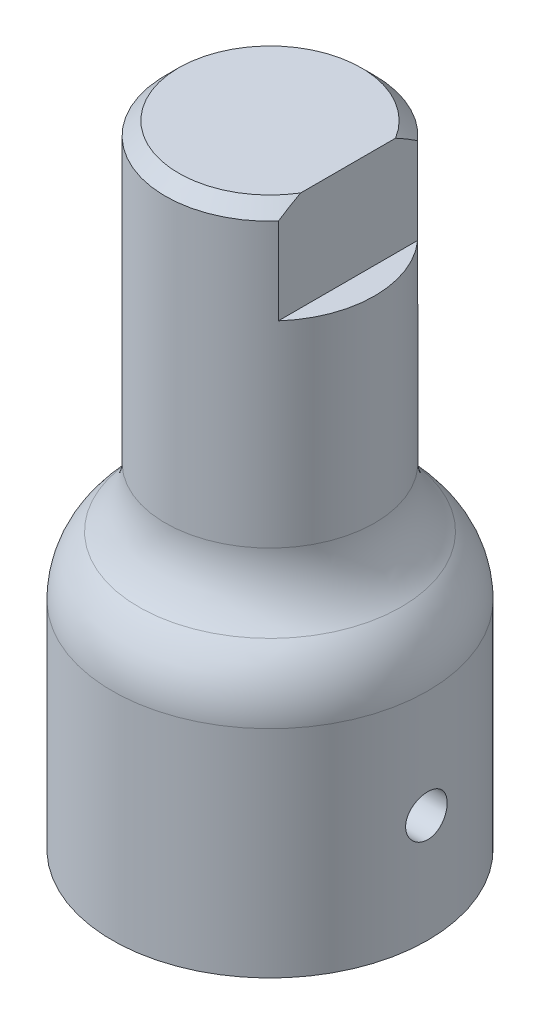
from build123d import *

# Parameters (mm, degrees)
LINEAR_AUSTRAGEN1_DEPTH = 6
LINEAR_AUSTRAGEN2_DEPTH = 12.7
BOHRUNG1_D              = 2.5
BOHRUNG1_DEPTH          = 4.65
FASE1_SIZE              = 0.8


with BuildPart() as part:
    # Skizze1 → Rotation1 (revolve)
    with BuildSketch(Plane.XY):
        with BuildLine():
            Line((6.3, 38), (0, 38))
            Line((0, 38), (0, 0))
            Line((0, 0), (9.5, 0))
            Line((9.5, 0), (9.5, 13))
            ThreePointArc((9.5, 13), (9.08178046, 14.959591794), (7.9, 16.577708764))
            ThreePointArc((7.9, 16.577708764), (6.71821954, 18.195825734), (6.3, 20.155417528))
            Line((6.3, 20.155417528), (6.3, 38))
        make_face()
    revolve(axis=Axis((0, 38, 0), (0, -1, 0)))

    # Skizze2 → Linear austragen1 (cut)
    with BuildSketch(Plane(origin=(0, 38, 0), x_dir=(-1, 0, 0), z_dir=(0, 1, 0))):
        with BuildLine():
            Line((-4.7, -4.195235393), (-4.7, 4.195235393))
            ThreePointArc((-4.7, 4.195235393), (-6.3, 0), (-4.7, -4.195235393))
        make_face()
    extrude(amount=-LINEAR_AUSTRAGEN1_DEPTH, mode=Mode.SUBTRACT)

    # Skizze3 → Linear austragen2 (cut)
    with BuildSketch(Plane.XZ):
        with BuildLine():
            Line((4.85, -4.098780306), (4.85, 4.098780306))
            ThreePointArc((4.85, 4.098780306), (-6.35, 0), (4.85, -4.098780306))
        make_face()
    extrude(amount=-LINEAR_AUSTRAGEN2_DEPTH, mode=Mode.SUBTRACT)

    # Bohrung1
    with Locations(Plane.ZY.offset(-4.85)):
        with Locations((0, 6.5)):
            Hole(BOHRUNG1_D / 2, depth=BOHRUNG1_DEPTH)

    # Fase1
    fase1_edges = [part.edges().sort_by_distance(p)[0] for p in [
        (-6.3, 38, 0),
    ]]
    chamfer(fase1_edges, length=FASE1_SIZE)


solid = part.part
